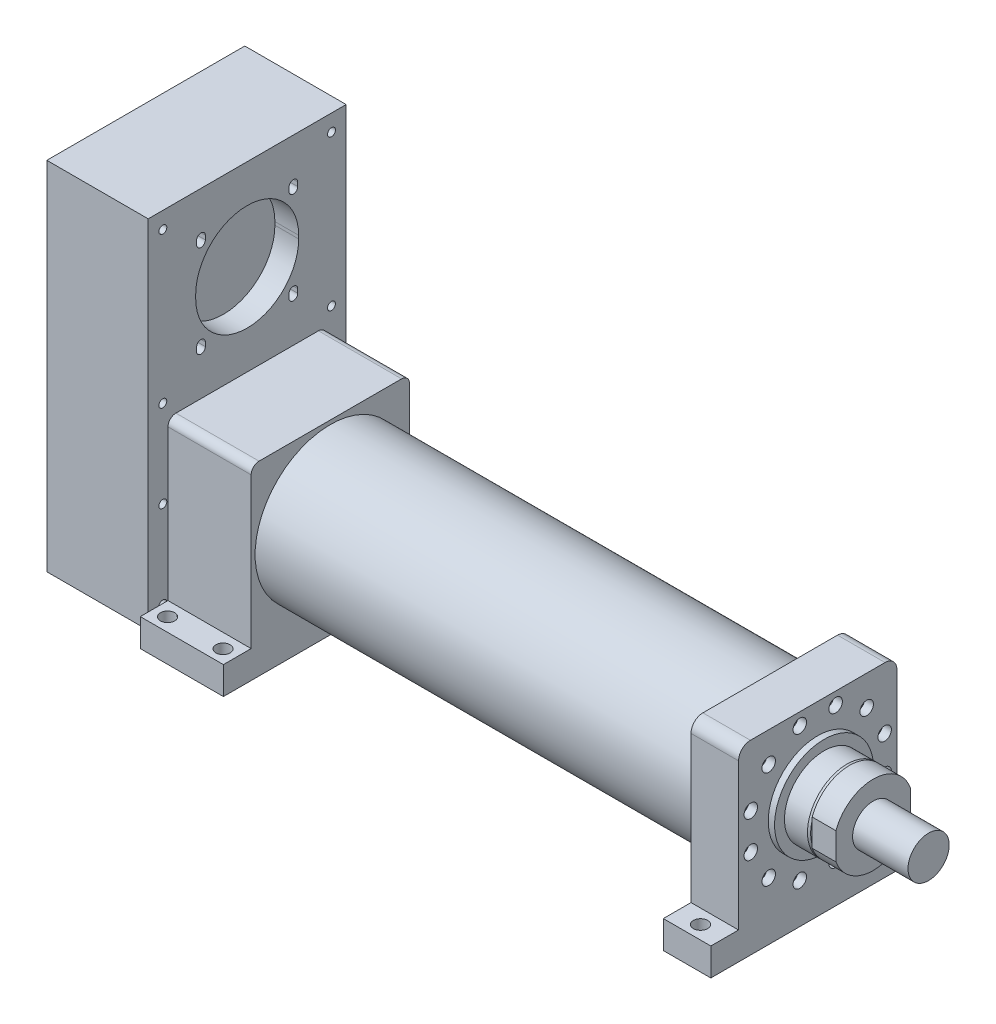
from build123d import *

# Parameters (mm, degrees)
SKETCH_1_R           = 95
SKETCH_1_R_2         = 80
EXTRUDE_1_DEPTH      = 555.5
EXTRUDE_2_DEPTH      = 60
SKETCH_3_R           = 62.5
EXTRUDE_3_DEPTH      = 8
SKETCH_4_R           = 8.5
CUT_EXTRUDE_3_DEPTH  = 11
SKETCH_6_R           = 50
EXTRUDE_4_DEPTH      = 32
CHAMFER_1_SIZE       = 3
CHAMFER_1_SIZE2      = 1.091910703
EXTRUDE_5_DEPTH      = 30
SKETCH_8_R           = 26
CUT_EXTRUDE_4_DEPTH  = 82
EXTRUDE_6_DEPTH      = 105
SKETCH_14_W          = 250
SKETCH_14_H          = 450
EXTRUDE_8_DEPTH      = 128
SKETCH_15_R          = 5
CUT_EXTRUDE_10_DEPTH = 128
CUT_EXTRUDE_11_DEPTH = 30
SKETCH_16_R          = 26
EXTRUDE_9_DEPTH      = 70
SKETCH_4_6_R         = 5.5
CUT_EXTRUDE_13_DEPTH = 92
SKETCH_17_W          = 105
SKETCH_17_H          = 270
SKETCH_17_R          = 9
SKETCH_17_W_2        = 60
EXTRUDE_10_DEPTH     = 35


with BuildPart() as part:
    # Sketch 1 → Extrude 1 (new body)
    with BuildSketch(Plane(origin=(0, 0, 0), x_dir=(0, 0, -1), z_dir=(1, 0, 0))):
        Circle(SKETCH_1_R)
        Circle(SKETCH_1_R_2, mode=Mode.SUBTRACT)
    extrude(amount=EXTRUDE_1_DEPTH)

    # Sketch 2 → Extrude 2 (add)
    with BuildSketch(Plane(origin=(555.5, 0, 0), x_dir=(0, 0, -1), z_dir=(1, 0, 0))):
        with BuildLine():
            Line((-100, -85), (-100, -100))
            Line((-100, -100), (-85, -100))
            Line((-85, -100), (85, -100))
            Line((85, -100), (100, -100))
            Line((100, -100), (100, -85))
            Line((100, -85), (100, 85))
            ThreePointArc((100, 85), (95.606601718, 95.606601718), (85, 100))
            Line((85, 100), (-85, 100))
            ThreePointArc((-85, 100), (-95.606601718, 95.606601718), (-100, 85))
            Line((-100, 85), (-100, -85))
        make_face()
    extrude(amount=EXTRUDE_2_DEPTH)

    # Sketch 4 → Cut-Extrude 3 (cut)
    with BuildSketch(Plane(origin=(615.5, 0, 0), x_dir=(0, 0, -1), z_dir=(1, 0, 0))):
        with Locations((-22.646666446, 84.5185098)):
            Circle(SKETCH_4_R)
        with Locations((22.646666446, 84.5185098)):
            Circle(SKETCH_4_R)
        with Locations((61.871843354, 61.871843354)):
            Circle(SKETCH_4_R)
        with Locations((84.5185098, 22.646666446)):
            Circle(SKETCH_4_R)
        with Locations((84.5185098, -22.646666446)):
            Circle(SKETCH_4_R)
        with Locations((61.871843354, -61.871843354)):
            Circle(SKETCH_4_R)
        with Locations((22.646666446, -84.5185098)):
            Circle(SKETCH_4_R)
        with Locations((-22.646666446, -84.5185098)):
            Circle(SKETCH_4_R)
        with Locations((-61.871843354, -61.871843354)):
            Circle(SKETCH_4_R)
        with Locations((-84.5185098, -22.646666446)):
            Circle(SKETCH_4_R)
        with Locations((-84.5185098, 22.646666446)):
            Circle(SKETCH_4_R)
        with Locations((-61.871843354, 61.871843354)):
            Circle(SKETCH_4_R)
    extrude(amount=-CUT_EXTRUDE_3_DEPTH, mode=Mode.SUBTRACT)

    # Sketch 8 → Cut-Extrude 4 (cut)
    with BuildSketch(Plane(origin=(685.5, 0, 0), x_dir=(0, 0, -1), z_dir=(1, 0, 0))):
        Circle(SKETCH_8_R)
    extrude(amount=-CUT_EXTRUDE_4_DEPTH, mode=Mode.SUBTRACT)

    # Sketch 9 → Extrude 6 (add)
    with BuildSketch(Plane.ZY):
        with BuildLine():
            Line((100, -90), (100, -100))
            Line((100, -100), (90, -100))
            Line((90, -100), (-90, -100))
            Line((-90, -100), (-100, -100))
            Line((-100, -100), (-100, -90))
            Line((-100, -90), (-100, 90))
            ThreePointArc((-100, 90), (-97.071067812, 97.071067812), (-90, 100))
            Line((-90, 100), (90, 100))
            ThreePointArc((90, 100), (97.071067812, 97.071067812), (100, 90))
            Line((100, 90), (100, -90))
        make_face()
    extrude(amount=EXTRUDE_6_DEPTH)

    # Sketch 14 → Extrude 8 (add)
    with BuildSketch(Plane.ZY.offset(105)):
        with Locations((0, 105)):
            Rectangle(SKETCH_14_W, SKETCH_14_H)
    extrude(amount=EXTRUDE_8_DEPTH)

    # Sketch 15 → Cut-Extrude 10 (cut)
    with BuildSketch(Plane(origin=(-105, 0, 0), x_dir=(0, 0, -1), z_dir=(1, 0, 0))):
        with Locations((-106.5, 309)):
            Circle(SKETCH_15_R)
        with Locations((106.5, 309)):
            Circle(SKETCH_15_R)
        with Locations((106.5, 119)):
            Circle(SKETCH_15_R)
        with Locations((-106.5, 119)):
            Circle(SKETCH_15_R)
        with Locations((-106.5, 9)):
            Circle(SKETCH_15_R)
        with Locations((106.5, 9)):
            Circle(SKETCH_15_R)
        with Locations((-106.5, -101)):
            Circle(SKETCH_15_R)
        with Locations((106.5, -101)):
            Circle(SKETCH_15_R)
    extrude(amount=-CUT_EXTRUDE_10_DEPTH, mode=Mode.SUBTRACT)

    # Sketch 15_3 → Cut-Extrude 11 (cut)
    with BuildSketch(Plane(origin=(-105, 0, 0), x_dir=(0, 0, -1), z_dir=(1, 0, 0))):
        with BuildLine():
            Line((-65, 217), (-65, 213))
            ThreePointArc((-65, 213), (0, 148), (65, 213))
            Line((65, 213), (65, 217))
            ThreePointArc((65, 217), (0, 282), (-65, 217))
        make_face()
        with BuildLine():
            Line((-63.836309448, 270.836309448), (-63.836309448, 275.836309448))
            ThreePointArc((-63.836309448, 275.836309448), (-58.336309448, 281.336309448), (-52.836309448, 275.836309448))
            Line((-52.836309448, 275.836309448), (-52.836309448, 270.836309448))
            ThreePointArc((-52.836309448, 270.836309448), (-58.336309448, 265.336309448), (-63.836309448, 270.836309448))
        make_face()
        with BuildLine():
            Line((63.836309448, 270.836309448), (63.836309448, 275.836309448))
            ThreePointArc((63.836309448, 275.836309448), (58.336309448, 281.336309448), (52.836309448, 275.836309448))
            Line((52.836309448, 275.836309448), (52.836309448, 270.836309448))
            ThreePointArc((52.836309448, 270.836309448), (58.336309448, 265.336309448), (63.836309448, 270.836309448))
        make_face()
        with BuildLine():
            Line((63.836309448, 159.163690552), (63.836309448, 154.163690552))
            ThreePointArc((63.836309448, 154.163690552), (58.336309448, 148.663690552), (52.836309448, 154.163690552))
            Line((52.836309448, 154.163690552), (52.836309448, 159.163690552))
            ThreePointArc((52.836309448, 159.163690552), (58.336309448, 164.663690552), (63.836309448, 159.163690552))
        make_face()
        with BuildLine():
            Line((-63.836309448, 159.163690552), (-63.836309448, 154.163690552))
            ThreePointArc((-63.836309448, 154.163690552), (-58.336309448, 148.663690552), (-52.836309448, 154.163690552))
            Line((-52.836309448, 154.163690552), (-52.836309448, 159.163690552))
            ThreePointArc((-52.836309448, 159.163690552), (-58.336309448, 164.663690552), (-63.836309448, 159.163690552))
        make_face()
    extrude(amount=-CUT_EXTRUDE_11_DEPTH, mode=Mode.SUBTRACT)

    # Sketch 4_6 → Cut-Extrude 13 (cut)
    with BuildSketch(Plane(origin=(615.5, 0, 0), x_dir=(0, 0, -1), z_dir=(1, 0, 0))):
        with Locations((-22.646666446, 84.5185098)):
            Circle(SKETCH_4_6_R)
        with Locations((22.646666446, 84.5185098)):
            Circle(SKETCH_4_6_R)
        with Locations((61.871843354, 61.871843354)):
            Circle(SKETCH_4_6_R)
        with Locations((84.5185098, 22.646666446)):
            Circle(SKETCH_4_6_R)
        with Locations((84.5185098, -22.646666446)):
            Circle(SKETCH_4_6_R)
        with Locations((61.871843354, -61.871843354)):
            Circle(SKETCH_4_6_R)
        with Locations((22.646666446, -84.5185098)):
            Circle(SKETCH_4_6_R)
        with Locations((-22.646666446, -84.5185098)):
            Circle(SKETCH_4_6_R)
        with Locations((-61.871843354, -61.871843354)):
            Circle(SKETCH_4_6_R)
        with Locations((-84.5185098, -22.646666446)):
            Circle(SKETCH_4_6_R)
        with Locations((-84.5185098, 22.646666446)):
            Circle(SKETCH_4_6_R)
        with Locations((-61.871843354, 61.871843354)):
            Circle(SKETCH_4_6_R)
    extrude(amount=-CUT_EXTRUDE_13_DEPTH, mode=Mode.SUBTRACT)

    # Sketch 17 → Extrude 10 (add)
    # profile 1 of 2: a face of its own
    with BuildSketch(Plane.XZ.offset(100)):
        with Locations((-52.5, 0)):
            Rectangle(SKETCH_17_W, SKETCH_17_H)
        with Locations(Location((-87.5, 118.004392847, 0), (0, 0, 270))):
            Circle(SKETCH_17_R, mode=Mode.SUBTRACT)
        with Locations(Location((-17.5, 118.004392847, 0), (0, 0, 270))):
            Circle(SKETCH_17_R, mode=Mode.SUBTRACT)
        with Locations(Location((-87.5, -118.240368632, 0), (0, 0, 270))):
            Circle(SKETCH_17_R, mode=Mode.SUBTRACT)
        with Locations(Location((-17.5, -118.240368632, 0), (0, 0, 270))):
            Circle(SKETCH_17_R, mode=Mode.SUBTRACT)
    # profile 2 of 2: a face of its own
    with BuildSketch(Plane.XZ.offset(100)):
        with Locations((585.5, 0)):
            Rectangle(SKETCH_17_W_2, SKETCH_17_H)
        with Locations(Location((585.5, 118.004392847, 0), (0, 0, 270))):
            Circle(SKETCH_17_R, mode=Mode.SUBTRACT)
        with Locations(Location((585.5, -118.240368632, 0), (0, 0, 270))):
            Circle(SKETCH_17_R, mode=Mode.SUBTRACT)
    extrude(amount=EXTRUDE_10_DEPTH)


with BuildPart() as body_2:
    # Sketch 3 → Extrude 3 (new body)
    with BuildSketch(Plane(origin=(615.5, 0, 0), x_dir=(0, 0, -1), z_dir=(1, 0, 0))):
        Circle(SKETCH_3_R)
    extrude(amount=EXTRUDE_3_DEPTH)


with BuildPart() as body_3:
    # Sketch 6 → Extrude 4 (new body)
    with BuildSketch(Plane(origin=(623.5, 0, 0), x_dir=(0, 0, -1), z_dir=(1, 0, 0))):
        Circle(SKETCH_6_R)
    extrude(amount=EXTRUDE_4_DEPTH)

    # Chamfer 1
    chamfer_1_edges = [body_3.edges().sort_by_distance(p)[0] for p in [
        (655.5, 0, 50),
    ]]
    chamfer_1_side = [body_3.faces().sort_by_distance(p)[0] for p in [
        (639.5, 0, 50),
    ]]
    chamfer(chamfer_1_edges, length=CHAMFER_1_SIZE, length2=CHAMFER_1_SIZE2, reference=chamfer_1_side[0])


with BuildPart() as body_4:
    # Sketch 7 → Extrude 5 (new body)
    with BuildSketch(Plane(origin=(655.5, 0, 0), x_dir=(0, 0, -1), z_dir=(1, 0, 0))):
        with BuildLine():
            Line((-47, 17.058722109), (-47, -17.058722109))
            ThreePointArc((-47, -17.058722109), (0, -50), (47, -17.058722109))
            Line((47, -17.058722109), (47, 17.058722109))
            ThreePointArc((47, 17.058722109), (0, 50), (-47, 17.058722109))
        make_face()
    extrude(amount=EXTRUDE_5_DEPTH)


with BuildPart() as body_5:
    # Sketch 16 → Extrude 9 (new body)
    with BuildSketch(Plane(origin=(685.5, 0, 0), x_dir=(0, 0, -1), z_dir=(1, 0, 0))):
        Circle(SKETCH_16_R)
    extrude(amount=EXTRUDE_9_DEPTH)


solid = Compound([part.part, body_2.part, body_3.part, body_4.part, body_5.part])
